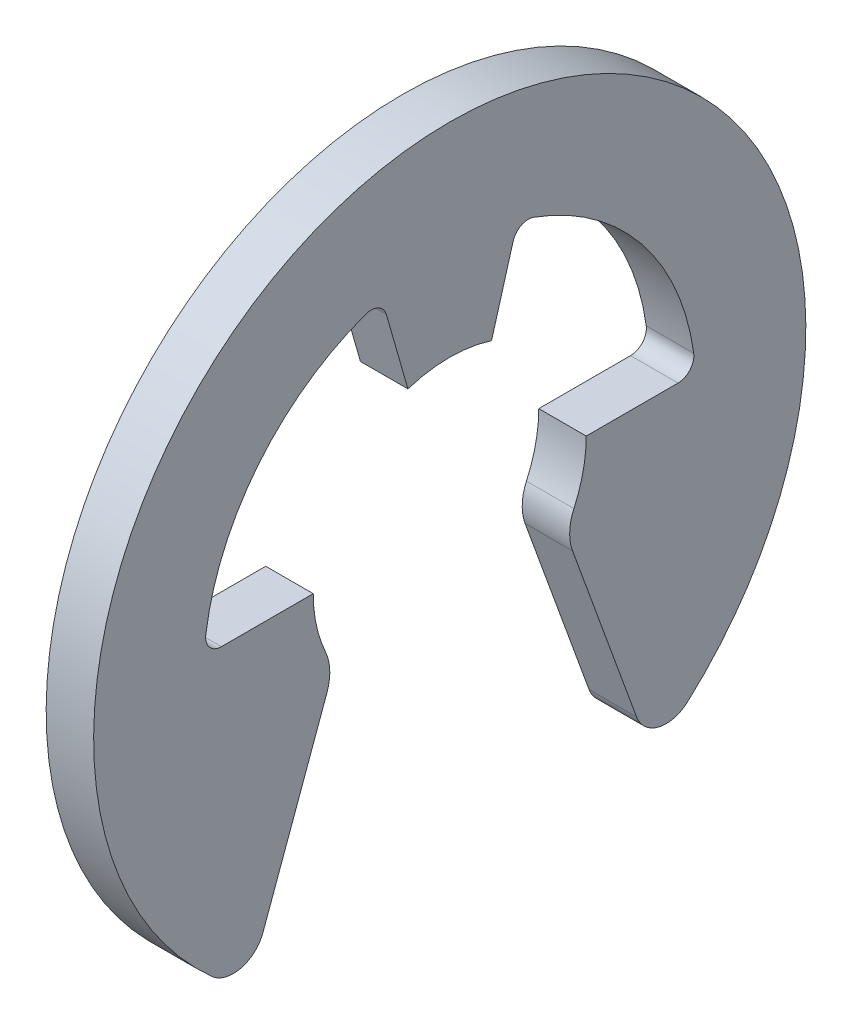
ISO-10303-21;
HEADER;
FILE_DESCRIPTION(('STEP AP214'),'2;1');
FILE_NAME('part.step','',(''),(''),'','','');
FILE_SCHEMA(('AUTOMOTIVE_DESIGN { 1 0 10303 214 1 1 1 1 }'));
ENDSEC;
DATA;
#1=APPLICATION_CONTEXT('core data for automotive mechanical design processes');
#2=APPLICATION_PROTOCOL_DEFINITION('international standard','automotive_design',2000,#1);
#3=PRODUCT_CONTEXT('',#1,'mechanical');
#4=PRODUCT('Part','Part','',(#3));
#5=PRODUCT_RELATED_PRODUCT_CATEGORY('part','',(#4));
#6=PRODUCT_DEFINITION_FORMATION('','',#4);
#7=PRODUCT_DEFINITION_CONTEXT('part definition',#1,'design');
#8=PRODUCT_DEFINITION('design','',#6,#7);
#9=PRODUCT_DEFINITION_SHAPE('','',#8);
#10=(LENGTH_UNIT() NAMED_UNIT(*) SI_UNIT(.MILLI.,.METRE.));
#11=(NAMED_UNIT(*) PLANE_ANGLE_UNIT() SI_UNIT($,.RADIAN.));
#12=(NAMED_UNIT(*) SI_UNIT($,.STERADIAN.) SOLID_ANGLE_UNIT());
#13=UNCERTAINTY_MEASURE_WITH_UNIT(LENGTH_MEASURE(1.E-05),#10,'distance_accuracy_value','');
#14=(GEOMETRIC_REPRESENTATION_CONTEXT(3) GLOBAL_UNCERTAINTY_ASSIGNED_CONTEXT((#13)) GLOBAL_UNIT_ASSIGNED_CONTEXT((#10,
#11,#12)) REPRESENTATION_CONTEXT('',''));
#15=CARTESIAN_POINT('',(0.,0.,0.));
#16=DIRECTION('',(0.,0.,1.));
#17=DIRECTION('',(1.,0.,0.));
#18=AXIS2_PLACEMENT_3D('',#15,#16,#17);
#19=CARTESIAN_POINT('',(0.4,0.266666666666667,-1.92326761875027));
#20=DIRECTION('',(-1.,0.,0.));
#21=DIRECTION('',(0.,0.,1.));
#22=AXIS2_PLACEMENT_3D('',#19,#20,#21);
#23=CYLINDRICAL_SURFACE('',#22,0.133333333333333);
#24=CARTESIAN_POINT('',(0.,0.266666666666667,-1.92326761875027));
#25=DIRECTION('',(-1.,0.,0.));
#26=DIRECTION('',(0.,0.,1.));
#27=AXIS2_PLACEMENT_3D('',#24,#25,#26);
#28=CIRCLE('',#27,0.133333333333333);
#29=CARTESIAN_POINT('',(0.,0.284978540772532,-2.05533749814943));
#30=VERTEX_POINT('',#29);
#31=CARTESIAN_POINT('',(0.,0.133333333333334,-1.92326761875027));
#32=VERTEX_POINT('',#31);
#33=EDGE_CURVE('E179',#30,#32,#28,.T.);
#34=ORIENTED_EDGE('',*,*,#33,.T.);
#35=DIRECTION('',(-1.,0.,0.));
#36=VECTOR('',#35,1.);
#37=CARTESIAN_POINT('',(0.4,0.133333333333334,-1.92326761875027));
#38=LINE('',#37,#36);
#39=CARTESIAN_POINT('',(0.4,0.133333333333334,-1.92326761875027));
#40=VERTEX_POINT('',#39);
#41=EDGE_CURVE('E11',#40,#32,#38,.T.);
#42=ORIENTED_EDGE('',*,*,#41,.F.);
#43=CARTESIAN_POINT('',(0.4,0.266666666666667,-1.92326761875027));
#44=DIRECTION('',(-1.,0.,0.));
#45=DIRECTION('',(0.,0.,1.));
#46=AXIS2_PLACEMENT_3D('',#43,#44,#45);
#47=CIRCLE('',#46,0.133333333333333);
#48=CARTESIAN_POINT('',(0.4,0.284978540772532,-2.05533749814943));
#49=VERTEX_POINT('',#48);
#50=EDGE_CURVE('E238',#49,#40,#47,.T.);
#51=ORIENTED_EDGE('',*,*,#50,.F.);
#52=DIRECTION('',(-1.,0.,0.));
#53=VECTOR('',#52,1.);
#54=CARTESIAN_POINT('',(0.4,0.284978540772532,-2.05533749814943));
#55=LINE('',#54,#53);
#56=EDGE_CURVE('E47',#49,#30,#55,.T.);
#57=ORIENTED_EDGE('',*,*,#56,.T.);
#58=EDGE_LOOP('',(#34,#42,#51,#57));
#59=FACE_BOUND('',#58,.T.);
#60=ADVANCED_FACE('F33',(#59),#23,.F.);
#61=CARTESIAN_POINT('',(0.4,0.133333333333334,-1.15));
#62=DIRECTION('',(0.,1.,0.));
#63=DIRECTION('',(0.,0.,1.));
#64=AXIS2_PLACEMENT_3D('',#61,#62,#63);
#65=PLANE('',#64);
#66=DIRECTION('',(0.,0.,-1.));
#67=VECTOR('',#66,1.);
#68=CARTESIAN_POINT('',(0.,0.133333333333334,-1.15));
#69=LINE('',#68,#67);
#70=CARTESIAN_POINT('',(0.,0.133333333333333,-1.15));
#71=VERTEX_POINT('',#70);
#72=EDGE_CURVE('E174',#71,#32,#69,.T.);
#73=ORIENTED_EDGE('',*,*,#72,.F.);
#74=DIRECTION('',(-1.,0.,0.));
#75=VECTOR('',#74,1.);
#76=CARTESIAN_POINT('',(0.4,0.133333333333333,-1.15));
#77=LINE('',#76,#75);
#78=CARTESIAN_POINT('',(0.4,0.133333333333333,-1.15));
#79=VERTEX_POINT('',#78);
#80=EDGE_CURVE('E40',#79,#71,#77,.T.);
#81=ORIENTED_EDGE('',*,*,#80,.F.);
#82=DIRECTION('',(0.,0.,-1.));
#83=VECTOR('',#82,1.);
#84=CARTESIAN_POINT('',(0.4,0.133333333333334,-1.15));
#85=LINE('',#84,#83);
#86=EDGE_CURVE('E176',#79,#40,#85,.T.);
#87=ORIENTED_EDGE('',*,*,#86,.T.);
#88=ORIENTED_EDGE('',*,*,#41,.T.);
#89=EDGE_LOOP('',(#73,#81,#87,#88));
#90=FACE_BOUND('',#89,.T.);
#91=ADVANCED_FACE('F172',(#90),#65,.T.);
#92=CARTESIAN_POINT('',(0.4,0.133333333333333,0.));
#93=DIRECTION('',(-1.,0.,0.));
#94=DIRECTION('',(0.,0.,1.));
#95=AXIS2_PLACEMENT_3D('',#92,#93,#94);
#96=CYLINDRICAL_SURFACE('',#95,1.15);
#97=CARTESIAN_POINT('',(0.,0.133333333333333,0.));
#98=DIRECTION('',(-1.,0.,0.));
#99=DIRECTION('',(0.,0.,1.));
#100=AXIS2_PLACEMENT_3D('',#97,#98,#99);
#101=CIRCLE('',#100,1.15);
#102=CARTESIAN_POINT('',(0.,-0.343754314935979,-1.04636866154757));
#103=VERTEX_POINT('',#102);
#104=EDGE_CURVE('E187',#71,#103,#101,.T.);
#105=ORIENTED_EDGE('',*,*,#104,.T.);
#106=DIRECTION('',(-1.,0.,0.));
#107=VECTOR('',#106,1.);
#108=CARTESIAN_POINT('',(0.4,-0.343754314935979,-1.04636866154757));
#109=LINE('',#108,#107);
#110=CARTESIAN_POINT('',(0.4,-0.343754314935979,-1.04636866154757));
#111=VERTEX_POINT('',#110);
#112=EDGE_CURVE('E318',#111,#103,#109,.T.);
#113=ORIENTED_EDGE('',*,*,#112,.F.);
#114=CARTESIAN_POINT('',(0.4,0.133333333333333,0.));
#115=DIRECTION('',(-1.,0.,0.));
#116=DIRECTION('',(0.,0.,1.));
#117=AXIS2_PLACEMENT_3D('',#114,#115,#116);
#118=CIRCLE('',#117,1.15);
#119=EDGE_CURVE('E241',#79,#111,#118,.T.);
#120=ORIENTED_EDGE('',*,*,#119,.F.);
#121=ORIENTED_EDGE('',*,*,#80,.T.);
#122=EDGE_LOOP('',(#105,#113,#120,#121));
#123=FACE_BOUND('',#122,.T.);
#124=ADVANCED_FACE('F321',(#123),#96,.F.);
#125=CARTESIAN_POINT('',(0.4,-0.509697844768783,-1.4103229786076));
#126=DIRECTION('',(-1.,0.,0.));
#127=DIRECTION('',(0.,0.,1.));
#128=AXIS2_PLACEMENT_3D('',#125,#126,#127);
#129=CYLINDRICAL_SURFACE('',#128,0.400000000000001);
#130=CARTESIAN_POINT('',(0.,-0.509697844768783,-1.4103229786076));
#131=DIRECTION('',(-1.,0.,0.));
#132=DIRECTION('',(0.,0.,1.));
#133=AXIS2_PLACEMENT_3D('',#130,#131,#132);
#134=CIRCLE('',#133,0.400000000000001);
#135=CARTESIAN_POINT('',(0.,-0.646505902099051,-1.03444593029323));
#136=VERTEX_POINT('',#135);
#137=EDGE_CURVE('E189',#136,#103,#134,.T.);
#138=ORIENTED_EDGE('',*,*,#137,.F.);
#139=DIRECTION('',(-1.,0.,0.));
#140=VECTOR('',#139,1.);
#141=CARTESIAN_POINT('',(0.4,-0.646505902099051,-1.03444593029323));
#142=LINE('',#141,#140);
#143=CARTESIAN_POINT('',(0.4,-0.646505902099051,-1.03444593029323));
#144=VERTEX_POINT('',#143);
#145=EDGE_CURVE('E316',#144,#136,#142,.T.);
#146=ORIENTED_EDGE('',*,*,#145,.F.);
#147=CARTESIAN_POINT('',(0.4,-0.509697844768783,-1.4103229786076));
#148=DIRECTION('',(-1.,0.,0.));
#149=DIRECTION('',(0.,0.,1.));
#150=AXIS2_PLACEMENT_3D('',#147,#148,#149);
#151=CIRCLE('',#150,0.400000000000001);
#152=EDGE_CURVE('E243',#144,#111,#151,.T.);
#153=ORIENTED_EDGE('',*,*,#152,.T.);
#154=ORIENTED_EDGE('',*,*,#112,.T.);
#155=EDGE_LOOP('',(#138,#146,#153,#154));
#156=FACE_BOUND('',#155,.T.);
#157=ADVANCED_FACE('F392',(#156),#129,.T.);
#158=CARTESIAN_POINT('',(0.4,-0.646505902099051,-1.03444593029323));
#159=DIRECTION('',(0.,0.34202014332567,-0.939692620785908));
#160=DIRECTION('',(0.,0.939692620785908,0.34202014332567));
#161=AXIS2_PLACEMENT_3D('',#158,#159,#160);
#162=PLANE('',#161);
#163=DIRECTION('',(0.,-0.939692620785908,-0.34202014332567));
#164=VECTOR('',#163,1.);
#165=CARTESIAN_POINT('',(0.,-0.646505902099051,-1.03444593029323));
#166=LINE('',#165,#164);
#167=CARTESIAN_POINT('',(0.,-2.12701661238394,-1.57330776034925));
#168=VERTEX_POINT('',#167);
#169=EDGE_CURVE('E193',#136,#168,#166,.T.);
#170=ORIENTED_EDGE('',*,*,#169,.T.);
#171=DIRECTION('',(-1.,0.,0.));
#172=VECTOR('',#171,1.);
#173=CARTESIAN_POINT('',(0.4,-2.12701661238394,-1.57330776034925));
#174=LINE('',#173,#172);
#175=CARTESIAN_POINT('',(0.4,-2.12701661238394,-1.57330776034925));
#176=VERTEX_POINT('',#175);
#177=EDGE_CURVE('E314',#176,#168,#174,.T.);
#178=ORIENTED_EDGE('',*,*,#177,.F.);
#179=DIRECTION('',(0.,-0.939692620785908,-0.34202014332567));
#180=VECTOR('',#179,1.);
#181=CARTESIAN_POINT('',(0.4,-0.646505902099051,-1.03444593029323));
#182=LINE('',#181,#180);
#183=EDGE_CURVE('E246',#144,#176,#182,.T.);
#184=ORIENTED_EDGE('',*,*,#183,.F.);
#185=ORIENTED_EDGE('',*,*,#145,.T.);
#186=EDGE_LOOP('',(#170,#178,#184,#185));
#187=FACE_BOUND('',#186,.T.);
#188=ADVANCED_FACE('F389',(#187),#162,.F.);
#189=CARTESIAN_POINT('',(0.4,-2.03581124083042,-1.82389245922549));
#190=DIRECTION('',(-1.,0.,0.));
#191=DIRECTION('',(0.,0.,1.));
#192=AXIS2_PLACEMENT_3D('',#189,#190,#191);
#193=CYLINDRICAL_SURFACE('',#192,0.266666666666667);
#194=CARTESIAN_POINT('',(0.,-2.03581124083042,-1.82389245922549));
#195=DIRECTION('',(-1.,0.,0.));
#196=DIRECTION('',(0.,0.,1.));
#197=AXIS2_PLACEMENT_3D('',#194,#195,#196);
#198=CIRCLE('',#197,0.266666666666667);
#199=CARTESIAN_POINT('',(0.,-2.23442697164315,-2.0018331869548));
#200=VERTEX_POINT('',#199);
#201=EDGE_CURVE('E196',#200,#168,#198,.T.);
#202=ORIENTED_EDGE('',*,*,#201,.F.);
#203=DIRECTION('',(-1.,0.,0.));
#204=VECTOR('',#203,1.);
#205=CARTESIAN_POINT('',(0.4,-2.23442697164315,-2.0018331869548));
#206=LINE('',#205,#204);
#207=CARTESIAN_POINT('',(0.4,-2.23442697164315,-2.0018331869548));
#208=VERTEX_POINT('',#207);
#209=EDGE_CURVE('E312',#208,#200,#206,.T.);
#210=ORIENTED_EDGE('',*,*,#209,.F.);
#211=CARTESIAN_POINT('',(0.4,-2.03581124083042,-1.82389245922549));
#212=DIRECTION('',(-1.,0.,0.));
#213=DIRECTION('',(0.,0.,1.));
#214=AXIS2_PLACEMENT_3D('',#211,#212,#213);
#215=CIRCLE('',#214,0.266666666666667);
#216=EDGE_CURVE('E248',#208,#176,#215,.T.);
#217=ORIENTED_EDGE('',*,*,#216,.T.);
#218=ORIENTED_EDGE('',*,*,#177,.T.);
#219=EDGE_LOOP('',(#202,#210,#217,#218));
#220=FACE_BOUND('',#219,.T.);
#221=ADVANCED_FACE('F383',(#220),#193,.T.);
#222=CARTESIAN_POINT('',(0.4,0.,0.));
#223=DIRECTION('',(-1.,0.,0.));
#224=DIRECTION('',(0.,0.,1.));
#225=AXIS2_PLACEMENT_3D('',#222,#223,#224);
#226=CYLINDRICAL_SURFACE('',#225,3.);
#227=CARTESIAN_POINT('',(0.,0.,0.));
#228=DIRECTION('',(1.,0.,0.));
#229=DIRECTION('',(0.,0.,-1.));
#230=AXIS2_PLACEMENT_3D('',#227,#228,#229);
#231=CIRCLE('',#230,3.);
#232=CARTESIAN_POINT('',(0.,-2.23442697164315,2.0018331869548));
#233=VERTEX_POINT('',#232);
#234=EDGE_CURVE('E199',#200,#233,#231,.T.);
#235=ORIENTED_EDGE('',*,*,#234,.T.);
#236=DIRECTION('',(-1.,0.,0.));
#237=VECTOR('',#236,1.);
#238=CARTESIAN_POINT('',(0.4,-2.23442697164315,2.0018331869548));
#239=LINE('',#238,#237);
#240=CARTESIAN_POINT('',(0.4,-2.23442697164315,2.0018331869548));
#241=VERTEX_POINT('',#240);
#242=EDGE_CURVE('E309',#241,#233,#239,.T.);
#243=ORIENTED_EDGE('',*,*,#242,.F.);
#244=CARTESIAN_POINT('',(0.4,0.,0.));
#245=DIRECTION('',(1.,0.,0.));
#246=DIRECTION('',(0.,0.,-1.));
#247=AXIS2_PLACEMENT_3D('',#244,#245,#246);
#248=CIRCLE('',#247,3.);
#249=EDGE_CURVE('E251',#208,#241,#248,.T.);
#250=ORIENTED_EDGE('',*,*,#249,.F.);
#251=ORIENTED_EDGE('',*,*,#209,.T.);
#252=EDGE_LOOP('',(#235,#243,#250,#251));
#253=FACE_BOUND('',#252,.T.);
#254=ADVANCED_FACE('F393',(#253),#226,.T.);
#255=CARTESIAN_POINT('',(0.4,-2.03581124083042,1.82389245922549));
#256=DIRECTION('',(-1.,0.,0.));
#257=DIRECTION('',(0.,0.,1.));
#258=AXIS2_PLACEMENT_3D('',#255,#256,#257);
#259=CYLINDRICAL_SURFACE('',#258,0.266666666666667);
#260=CARTESIAN_POINT('',(0.,-2.03581124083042,1.82389245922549));
#261=DIRECTION('',(1.,0.,0.));
#262=DIRECTION('',(0.,0.,-1.));
#263=AXIS2_PLACEMENT_3D('',#260,#261,#262);
#264=CIRCLE('',#263,0.266666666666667);
#265=CARTESIAN_POINT('',(0.,-2.12701661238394,1.57330776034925));
#266=VERTEX_POINT('',#265);
#267=EDGE_CURVE('E201',#233,#266,#264,.T.);
#268=ORIENTED_EDGE('',*,*,#267,.T.);
#269=DIRECTION('',(-1.,0.,0.));
#270=VECTOR('',#269,1.);
#271=CARTESIAN_POINT('',(0.4,-2.12701661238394,1.57330776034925));
#272=LINE('',#271,#270);
#273=CARTESIAN_POINT('',(0.4,-2.12701661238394,1.57330776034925));
#274=VERTEX_POINT('',#273);
#275=EDGE_CURVE('E307',#274,#266,#272,.T.);
#276=ORIENTED_EDGE('',*,*,#275,.F.);
#277=CARTESIAN_POINT('',(0.4,-2.03581124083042,1.82389245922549));
#278=DIRECTION('',(1.,0.,0.));
#279=DIRECTION('',(0.,0.,-1.));
#280=AXIS2_PLACEMENT_3D('',#277,#278,#279);
#281=CIRCLE('',#280,0.266666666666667);
#282=EDGE_CURVE('E253',#241,#274,#281,.T.);
#283=ORIENTED_EDGE('',*,*,#282,.F.);
#284=ORIENTED_EDGE('',*,*,#242,.T.);
#285=EDGE_LOOP('',(#268,#276,#283,#284));
#286=FACE_BOUND('',#285,.T.);
#287=ADVANCED_FACE('F376',(#286),#259,.T.);
#288=CARTESIAN_POINT('',(0.4,-0.646505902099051,1.03444593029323));
#289=DIRECTION('',(0.,-0.342020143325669,-0.939692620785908));
#290=DIRECTION('',(0.,0.939692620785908,-0.342020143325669));
#291=AXIS2_PLACEMENT_3D('',#288,#289,#290);
#292=PLANE('',#291);
#293=DIRECTION('',(0.,-0.939692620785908,0.342020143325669));
#294=VECTOR('',#293,1.);
#295=CARTESIAN_POINT('',(0.,-0.646505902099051,1.03444593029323));
#296=LINE('',#295,#294);
#297=CARTESIAN_POINT('',(0.,-0.646505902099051,1.03444593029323));
#298=VERTEX_POINT('',#297);
#299=EDGE_CURVE('E204',#298,#266,#296,.T.);
#300=ORIENTED_EDGE('',*,*,#299,.F.);
#301=DIRECTION('',(-1.,0.,0.));
#302=VECTOR('',#301,1.);
#303=CARTESIAN_POINT('',(0.4,-0.646505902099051,1.03444593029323));
#304=LINE('',#303,#302);
#305=CARTESIAN_POINT('',(0.4,-0.646505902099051,1.03444593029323));
#306=VERTEX_POINT('',#305);
#307=EDGE_CURVE('E305',#306,#298,#304,.T.);
#308=ORIENTED_EDGE('',*,*,#307,.F.);
#309=DIRECTION('',(0.,-0.939692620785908,0.342020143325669));
#310=VECTOR('',#309,1.);
#311=CARTESIAN_POINT('',(0.4,-0.646505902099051,1.03444593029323));
#312=LINE('',#311,#310);
#313=EDGE_CURVE('E255',#306,#274,#312,.T.);
#314=ORIENTED_EDGE('',*,*,#313,.T.);
#315=ORIENTED_EDGE('',*,*,#275,.T.);
#316=EDGE_LOOP('',(#300,#308,#314,#315));
#317=FACE_BOUND('',#316,.T.);
#318=ADVANCED_FACE('F371',(#317),#292,.T.);
#319=CARTESIAN_POINT('',(0.4,-0.509697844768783,1.4103229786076));
#320=DIRECTION('',(-1.,0.,0.));
#321=DIRECTION('',(0.,0.,1.));
#322=AXIS2_PLACEMENT_3D('',#319,#320,#321);
#323=CYLINDRICAL_SURFACE('',#322,0.400000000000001);
#324=CARTESIAN_POINT('',(0.,-0.509697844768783,1.4103229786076));
#325=DIRECTION('',(1.,0.,0.));
#326=DIRECTION('',(0.,0.,-1.));
#327=AXIS2_PLACEMENT_3D('',#324,#325,#326);
#328=CIRCLE('',#327,0.400000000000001);
#329=CARTESIAN_POINT('',(0.,-0.343754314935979,1.04636866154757));
#330=VERTEX_POINT('',#329);
#331=EDGE_CURVE('E207',#298,#330,#328,.T.);
#332=ORIENTED_EDGE('',*,*,#331,.T.);
#333=DIRECTION('',(-1.,0.,0.));
#334=VECTOR('',#333,1.);
#335=CARTESIAN_POINT('',(0.4,-0.343754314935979,1.04636866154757));
#336=LINE('',#335,#334);
#337=CARTESIAN_POINT('',(0.4,-0.343754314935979,1.04636866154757));
#338=VERTEX_POINT('',#337);
#339=EDGE_CURVE('E303',#338,#330,#336,.T.);
#340=ORIENTED_EDGE('',*,*,#339,.F.);
#341=CARTESIAN_POINT('',(0.4,-0.509697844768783,1.4103229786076));
#342=DIRECTION('',(1.,0.,0.));
#343=DIRECTION('',(0.,0.,-1.));
#344=AXIS2_PLACEMENT_3D('',#341,#342,#343);
#345=CIRCLE('',#344,0.400000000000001);
#346=EDGE_CURVE('E258',#306,#338,#345,.T.);
#347=ORIENTED_EDGE('',*,*,#346,.F.);
#348=ORIENTED_EDGE('',*,*,#307,.T.);
#349=EDGE_LOOP('',(#332,#340,#347,#348));
#350=FACE_BOUND('',#349,.T.);
#351=ADVANCED_FACE('F367',(#350),#323,.T.);
#352=CARTESIAN_POINT('',(0.4,0.133333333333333,0.));
#353=DIRECTION('',(-1.,0.,0.));
#354=DIRECTION('',(0.,0.,1.));
#355=AXIS2_PLACEMENT_3D('',#352,#353,#354);
#356=CYLINDRICAL_SURFACE('',#355,1.15);
#357=CARTESIAN_POINT('',(0.,0.133333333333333,0.));
#358=DIRECTION('',(1.,0.,0.));
#359=DIRECTION('',(0.,0.,-1.));
#360=AXIS2_PLACEMENT_3D('',#357,#358,#359);
#361=CIRCLE('',#360,1.15);
#362=CARTESIAN_POINT('',(0.,0.133333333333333,1.15));
#363=VERTEX_POINT('',#362);
#364=EDGE_CURVE('E210',#363,#330,#361,.T.);
#365=ORIENTED_EDGE('',*,*,#364,.F.);
#366=DIRECTION('',(-1.,0.,0.));
#367=VECTOR('',#366,1.);
#368=CARTESIAN_POINT('',(0.4,0.133333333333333,1.15));
#369=LINE('',#368,#367);
#370=CARTESIAN_POINT('',(0.4,0.133333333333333,1.15));
#371=VERTEX_POINT('',#370);
#372=EDGE_CURVE('E301',#371,#363,#369,.T.);
#373=ORIENTED_EDGE('',*,*,#372,.F.);
#374=CARTESIAN_POINT('',(0.4,0.133333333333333,0.));
#375=DIRECTION('',(1.,0.,0.));
#376=DIRECTION('',(0.,0.,-1.));
#377=AXIS2_PLACEMENT_3D('',#374,#375,#376);
#378=CIRCLE('',#377,1.15);
#379=EDGE_CURVE('E260',#371,#338,#378,.T.);
#380=ORIENTED_EDGE('',*,*,#379,.T.);
#381=ORIENTED_EDGE('',*,*,#339,.T.);
#382=EDGE_LOOP('',(#365,#373,#380,#381));
#383=FACE_BOUND('',#382,.T.);
#384=ADVANCED_FACE('F361',(#383),#356,.F.);
#385=CARTESIAN_POINT('',(0.4,0.133333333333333,1.15));
#386=DIRECTION('',(0.,-1.,0.));
#387=DIRECTION('',(0.,0.,-1.));
#388=AXIS2_PLACEMENT_3D('',#385,#386,#387);
#389=PLANE('',#388);
#390=DIRECTION('',(0.,0.,1.));
#391=VECTOR('',#390,1.);
#392=CARTESIAN_POINT('',(0.,0.133333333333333,1.15));
#393=LINE('',#392,#391);
#394=CARTESIAN_POINT('',(0.,0.133333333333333,1.92326761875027));
#395=VERTEX_POINT('',#394);
#396=EDGE_CURVE('E213',#363,#395,#393,.T.);
#397=ORIENTED_EDGE('',*,*,#396,.T.);
#398=DIRECTION('',(-1.,0.,0.));
#399=VECTOR('',#398,1.);
#400=CARTESIAN_POINT('',(0.4,0.133333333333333,1.92326761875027));
#401=LINE('',#400,#399);
#402=CARTESIAN_POINT('',(0.4,0.133333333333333,1.92326761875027));
#403=VERTEX_POINT('',#402);
#404=EDGE_CURVE('E299',#403,#395,#401,.T.);
#405=ORIENTED_EDGE('',*,*,#404,.F.);
#406=DIRECTION('',(0.,0.,1.));
#407=VECTOR('',#406,1.);
#408=CARTESIAN_POINT('',(0.4,0.133333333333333,1.15));
#409=LINE('',#408,#407);
#410=EDGE_CURVE('E263',#371,#403,#409,.T.);
#411=ORIENTED_EDGE('',*,*,#410,.F.);
#412=ORIENTED_EDGE('',*,*,#372,.T.);
#413=EDGE_LOOP('',(#397,#405,#411,#412));
#414=FACE_BOUND('',#413,.T.);
#415=ADVANCED_FACE('F457',(#414),#389,.F.);
#416=CARTESIAN_POINT('',(0.4,0.266666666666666,1.92326761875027));
#417=DIRECTION('',(-1.,0.,0.));
#418=DIRECTION('',(0.,0.,1.));
#419=AXIS2_PLACEMENT_3D('',#416,#417,#418);
#420=CYLINDRICAL_SURFACE('',#419,0.133333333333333);
#421=CARTESIAN_POINT('',(0.,0.266666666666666,1.92326761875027));
#422=DIRECTION('',(1.,0.,0.));
#423=DIRECTION('',(0.,0.,-1.));
#424=AXIS2_PLACEMENT_3D('',#421,#422,#423);
#425=CIRCLE('',#424,0.133333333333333);
#426=CARTESIAN_POINT('',(0.,0.284978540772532,2.05533749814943));
#427=VERTEX_POINT('',#426);
#428=EDGE_CURVE('E216',#427,#395,#425,.T.);
#429=ORIENTED_EDGE('',*,*,#428,.F.);
#430=DIRECTION('',(-1.,0.,0.));
#431=VECTOR('',#430,1.);
#432=CARTESIAN_POINT('',(0.4,0.284978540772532,2.05533749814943));
#433=LINE('',#432,#431);
#434=CARTESIAN_POINT('',(0.4,0.284978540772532,2.05533749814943));
#435=VERTEX_POINT('',#434);
#436=EDGE_CURVE('E297',#435,#427,#433,.T.);
#437=ORIENTED_EDGE('',*,*,#436,.F.);
#438=CARTESIAN_POINT('',(0.4,0.266666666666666,1.92326761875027));
#439=DIRECTION('',(1.,0.,0.));
#440=DIRECTION('',(0.,0.,-1.));
#441=AXIS2_PLACEMENT_3D('',#438,#439,#440);
#442=CIRCLE('',#441,0.133333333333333);
#443=EDGE_CURVE('E265',#435,#403,#442,.T.);
#444=ORIENTED_EDGE('',*,*,#443,.T.);
#445=ORIENTED_EDGE('',*,*,#404,.T.);
#446=EDGE_LOOP('',(#429,#437,#444,#445));
#447=FACE_BOUND('',#446,.T.);
#448=ADVANCED_FACE('F354',(#447),#420,.F.);
#449=CARTESIAN_POINT('',(0.4,0.,0.));
#450=DIRECTION('',(-1.,0.,0.));
#451=DIRECTION('',(0.,0.,1.));
#452=AXIS2_PLACEMENT_3D('',#449,#450,#451);
#453=CYLINDRICAL_SURFACE('',#452,2.075);
#454=CARTESIAN_POINT('',(0.,0.,0.));
#455=DIRECTION('',(-1.,0.,0.));
#456=DIRECTION('',(0.,0.,1.));
#457=AXIS2_PLACEMENT_3D('',#454,#455,#456);
#458=CIRCLE('',#457,2.075);
#459=CARTESIAN_POINT('',(0.,1.95063428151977,0.707566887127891));
#460=VERTEX_POINT('',#459);
#461=EDGE_CURVE('E219',#427,#460,#458,.T.);
#462=ORIENTED_EDGE('',*,*,#461,.T.);
#463=DIRECTION('',(-1.,0.,0.));
#464=VECTOR('',#463,1.);
#465=CARTESIAN_POINT('',(0.4,1.95063428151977,0.707566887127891));
#466=LINE('',#465,#464);
#467=CARTESIAN_POINT('',(0.4,1.95063428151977,0.707566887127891));
#468=VERTEX_POINT('',#467);
#469=EDGE_CURVE('E294',#468,#460,#466,.T.);
#470=ORIENTED_EDGE('',*,*,#469,.F.);
#471=CARTESIAN_POINT('',(0.4,0.,0.));
#472=DIRECTION('',(-1.,0.,0.));
#473=DIRECTION('',(0.,0.,1.));
#474=AXIS2_PLACEMENT_3D('',#471,#472,#473);
#475=CIRCLE('',#474,2.075);
#476=EDGE_CURVE('E268',#435,#468,#475,.T.);
#477=ORIENTED_EDGE('',*,*,#476,.F.);
#478=ORIENTED_EDGE('',*,*,#436,.T.);
#479=EDGE_LOOP('',(#462,#470,#477,#478));
#480=FACE_BOUND('',#479,.T.);
#481=ADVANCED_FACE('F351',(#480),#453,.F.);
#482=CARTESIAN_POINT('',(0.4,1.82529231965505,0.662100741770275));
#483=DIRECTION('',(-1.,0.,0.));
#484=DIRECTION('',(0.,0.,1.));
#485=AXIS2_PLACEMENT_3D('',#482,#483,#484);
#486=CYLINDRICAL_SURFACE('',#485,0.133333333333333);
#487=CARTESIAN_POINT('',(0.,1.82529231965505,0.662100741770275));
#488=DIRECTION('',(-1.,0.,0.));
#489=DIRECTION('',(0.,0.,1.));
#490=AXIS2_PLACEMENT_3D('',#487,#488,#489);
#491=CIRCLE('',#490,0.133333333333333);
#492=CARTESIAN_POINT('',(0.,1.86204396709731,0.533932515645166));
#493=VERTEX_POINT('',#492);
#494=EDGE_CURVE('E221',#460,#493,#491,.T.);
#495=ORIENTED_EDGE('',*,*,#494,.T.);
#496=DIRECTION('',(-1.,0.,0.));
#497=VECTOR('',#496,1.);
#498=CARTESIAN_POINT('',(0.4,1.86204396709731,0.533932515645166));
#499=LINE('',#498,#497);
#500=CARTESIAN_POINT('',(0.4,1.86204396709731,0.533932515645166));
#501=VERTEX_POINT('',#500);
#502=EDGE_CURVE('E292',#501,#493,#499,.T.);
#503=ORIENTED_EDGE('',*,*,#502,.F.);
#504=CARTESIAN_POINT('',(0.4,1.82529231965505,0.662100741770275));
#505=DIRECTION('',(-1.,0.,0.));
#506=DIRECTION('',(0.,0.,1.));
#507=AXIS2_PLACEMENT_3D('',#504,#505,#506);
#508=CIRCLE('',#507,0.133333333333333);
#509=EDGE_CURVE('E270',#468,#501,#508,.T.);
#510=ORIENTED_EDGE('',*,*,#509,.F.);
#511=ORIENTED_EDGE('',*,*,#469,.T.);
#512=EDGE_LOOP('',(#495,#503,#510,#511));
#513=FACE_BOUND('',#512,.T.);
#514=ADVANCED_FACE('F346',(#513),#486,.F.);
#515=CARTESIAN_POINT('',(0.4,1.22808950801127,0.352148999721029));
#516=DIRECTION('',(0.,-0.275637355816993,0.961261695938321));
#517=DIRECTION('',(0.,-0.961261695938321,-0.275637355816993));
#518=AXIS2_PLACEMENT_3D('',#515,#516,#517);
#519=PLANE('',#518);
#520=DIRECTION('',(0.,0.961261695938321,0.275637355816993));
#521=VECTOR('',#520,1.);
#522=CARTESIAN_POINT('',(0.,1.22808950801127,0.352148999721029));
#523=LINE('',#522,#521);
#524=CARTESIAN_POINT('',(0.,1.22808950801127,0.352148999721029));
#525=VERTEX_POINT('',#524);
#526=EDGE_CURVE('E224',#525,#493,#523,.T.);
#527=ORIENTED_EDGE('',*,*,#526,.F.);
#528=DIRECTION('',(-1.,0.,0.));
#529=VECTOR('',#528,1.);
#530=CARTESIAN_POINT('',(0.4,1.22808950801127,0.352148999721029));
#531=LINE('',#530,#529);
#532=CARTESIAN_POINT('',(0.4,1.22808950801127,0.352148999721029));
#533=VERTEX_POINT('',#532);
#534=EDGE_CURVE('E290',#533,#525,#531,.T.);
#535=ORIENTED_EDGE('',*,*,#534,.F.);
#536=DIRECTION('',(0.,0.961261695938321,0.275637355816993));
#537=VECTOR('',#536,1.);
#538=CARTESIAN_POINT('',(0.4,1.22808950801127,0.352148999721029));
#539=LINE('',#538,#537);
#540=EDGE_CURVE('E272',#533,#501,#539,.T.);
#541=ORIENTED_EDGE('',*,*,#540,.T.);
#542=ORIENTED_EDGE('',*,*,#502,.T.);
#543=EDGE_LOOP('',(#527,#535,#541,#542));
#544=FACE_BOUND('',#543,.T.);
#545=ADVANCED_FACE('F340',(#544),#519,.T.);
#546=CARTESIAN_POINT('',(0.4,0.133333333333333,0.));
#547=DIRECTION('',(-1.,0.,0.));
#548=DIRECTION('',(0.,0.,1.));
#549=AXIS2_PLACEMENT_3D('',#546,#547,#548);
#550=CYLINDRICAL_SURFACE('',#549,1.15);
#551=CARTESIAN_POINT('',(0.,0.133333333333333,0.));
#552=DIRECTION('',(1.,0.,0.));
#553=DIRECTION('',(0.,0.,-1.));
#554=AXIS2_PLACEMENT_3D('',#551,#552,#553);
#555=CIRCLE('',#554,1.15);
#556=CARTESIAN_POINT('',(0.,1.22808950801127,-0.352148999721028));
#557=VERTEX_POINT('',#556);
#558=EDGE_CURVE('E227',#557,#525,#555,.T.);
#559=ORIENTED_EDGE('',*,*,#558,.F.);
#560=DIRECTION('',(-1.,0.,0.));
#561=VECTOR('',#560,1.);
#562=CARTESIAN_POINT('',(0.4,1.22808950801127,-0.352148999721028));
#563=LINE('',#562,#561);
#564=CARTESIAN_POINT('',(0.4,1.22808950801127,-0.352148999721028));
#565=VERTEX_POINT('',#564);
#566=EDGE_CURVE('E288',#565,#557,#563,.T.);
#567=ORIENTED_EDGE('',*,*,#566,.F.);
#568=CARTESIAN_POINT('',(0.4,0.133333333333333,0.));
#569=DIRECTION('',(1.,0.,0.));
#570=DIRECTION('',(0.,0.,-1.));
#571=AXIS2_PLACEMENT_3D('',#568,#569,#570);
#572=CIRCLE('',#571,1.15);
#573=EDGE_CURVE('E275',#565,#533,#572,.T.);
#574=ORIENTED_EDGE('',*,*,#573,.T.);
#575=ORIENTED_EDGE('',*,*,#534,.T.);
#576=EDGE_LOOP('',(#559,#567,#574,#575));
#577=FACE_BOUND('',#576,.T.);
#578=ADVANCED_FACE('F334',(#577),#550,.F.);
#579=CARTESIAN_POINT('',(0.4,1.22808950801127,-0.352148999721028));
#580=DIRECTION('',(0.,0.275637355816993,0.961261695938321));
#581=DIRECTION('',(0.,-0.961261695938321,0.275637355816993));
#582=AXIS2_PLACEMENT_3D('',#579,#580,#581);
#583=PLANE('',#582);
#584=DIRECTION('',(0.,0.961261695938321,-0.275637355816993));
#585=VECTOR('',#584,1.);
#586=CARTESIAN_POINT('',(0.,1.22808950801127,-0.352148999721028));
#587=LINE('',#586,#585);
#588=CARTESIAN_POINT('',(0.,1.86204396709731,-0.533932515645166));
#589=VERTEX_POINT('',#588);
#590=EDGE_CURVE('E230',#557,#589,#587,.T.);
#591=ORIENTED_EDGE('',*,*,#590,.T.);
#592=DIRECTION('',(-1.,0.,0.));
#593=VECTOR('',#592,1.);
#594=CARTESIAN_POINT('',(0.4,1.86204396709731,-0.533932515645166));
#595=LINE('',#594,#593);
#596=CARTESIAN_POINT('',(0.4,1.86204396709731,-0.533932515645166));
#597=VERTEX_POINT('',#596);
#598=EDGE_CURVE('E286',#597,#589,#595,.T.);
#599=ORIENTED_EDGE('',*,*,#598,.F.);
#600=DIRECTION('',(0.,0.961261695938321,-0.275637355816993));
#601=VECTOR('',#600,1.);
#602=CARTESIAN_POINT('',(0.4,1.22808950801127,-0.352148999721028));
#603=LINE('',#602,#601);
#604=EDGE_CURVE('E278',#565,#597,#603,.T.);
#605=ORIENTED_EDGE('',*,*,#604,.F.);
#606=ORIENTED_EDGE('',*,*,#566,.T.);
#607=EDGE_LOOP('',(#591,#599,#605,#606));
#608=FACE_BOUND('',#607,.T.);
#609=ADVANCED_FACE('F506',(#608),#583,.F.);
#610=CARTESIAN_POINT('',(0.4,1.82529231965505,-0.662100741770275));
#611=DIRECTION('',(-1.,0.,0.));
#612=DIRECTION('',(0.,0.,1.));
#613=AXIS2_PLACEMENT_3D('',#610,#611,#612);
#614=CYLINDRICAL_SURFACE('',#613,0.133333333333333);
#615=CARTESIAN_POINT('',(0.,1.82529231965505,-0.662100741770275));
#616=DIRECTION('',(1.,0.,0.));
#617=DIRECTION('',(0.,0.,-1.));
#618=AXIS2_PLACEMENT_3D('',#615,#616,#617);
#619=CIRCLE('',#618,0.133333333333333);
#620=CARTESIAN_POINT('',(0.,1.95063428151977,-0.70756688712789));
#621=VERTEX_POINT('',#620);
#622=EDGE_CURVE('E233',#621,#589,#619,.T.);
#623=ORIENTED_EDGE('',*,*,#622,.F.);
#624=DIRECTION('',(-1.,0.,0.));
#625=VECTOR('',#624,1.);
#626=CARTESIAN_POINT('',(0.4,1.95063428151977,-0.70756688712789));
#627=LINE('',#626,#625);
#628=CARTESIAN_POINT('',(0.4,1.95063428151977,-0.70756688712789));
#629=VERTEX_POINT('',#628);
#630=EDGE_CURVE('E55',#629,#621,#627,.T.);
#631=ORIENTED_EDGE('',*,*,#630,.F.);
#632=CARTESIAN_POINT('',(0.4,1.82529231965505,-0.662100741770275));
#633=DIRECTION('',(1.,0.,0.));
#634=DIRECTION('',(0.,0.,-1.));
#635=AXIS2_PLACEMENT_3D('',#632,#633,#634);
#636=CIRCLE('',#635,0.133333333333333);
#637=EDGE_CURVE('E280',#629,#597,#636,.T.);
#638=ORIENTED_EDGE('',*,*,#637,.T.);
#639=ORIENTED_EDGE('',*,*,#598,.T.);
#640=EDGE_LOOP('',(#623,#631,#638,#639));
#641=FACE_BOUND('',#640,.T.);
#642=ADVANCED_FACE('F328',(#641),#614,.F.);
#643=CARTESIAN_POINT('',(0.4,0.,0.));
#644=DIRECTION('',(-1.,0.,0.));
#645=DIRECTION('',(0.,0.,1.));
#646=AXIS2_PLACEMENT_3D('',#643,#644,#645);
#647=CYLINDRICAL_SURFACE('',#646,2.075);
#648=CARTESIAN_POINT('',(0.,0.,0.));
#649=DIRECTION('',(1.,0.,0.));
#650=DIRECTION('',(0.,0.,-1.));
#651=AXIS2_PLACEMENT_3D('',#648,#649,#650);
#652=CIRCLE('',#651,2.075);
#653=EDGE_CURVE('E236',#30,#621,#652,.T.);
#654=ORIENTED_EDGE('',*,*,#653,.F.);
#655=ORIENTED_EDGE('',*,*,#56,.F.);
#656=CARTESIAN_POINT('',(0.4,0.,0.));
#657=DIRECTION('',(1.,0.,0.));
#658=DIRECTION('',(0.,0.,-1.));
#659=AXIS2_PLACEMENT_3D('',#656,#657,#658);
#660=CIRCLE('',#659,2.075);
#661=EDGE_CURVE('E282',#49,#629,#660,.T.);
#662=ORIENTED_EDGE('',*,*,#661,.T.);
#663=ORIENTED_EDGE('',*,*,#630,.T.);
#664=EDGE_LOOP('',(#654,#655,#662,#663));
#665=FACE_BOUND('',#664,.T.);
#666=ADVANCED_FACE('F327',(#665),#647,.F.);
#667=CARTESIAN_POINT('',(0.4,0.266666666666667,-1.92326761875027));
#668=DIRECTION('',(-1.,0.,0.));
#669=DIRECTION('',(0.,0.,1.));
#670=AXIS2_PLACEMENT_3D('',#667,#668,#669);
#671=PLANE('',#670);
#672=ORIENTED_EDGE('',*,*,#50,.T.);
#673=ORIENTED_EDGE('',*,*,#86,.F.);
#674=ORIENTED_EDGE('',*,*,#119,.T.);
#675=ORIENTED_EDGE('',*,*,#152,.F.);
#676=ORIENTED_EDGE('',*,*,#183,.T.);
#677=ORIENTED_EDGE('',*,*,#216,.F.);
#678=ORIENTED_EDGE('',*,*,#249,.T.);
#679=ORIENTED_EDGE('',*,*,#282,.T.);
#680=ORIENTED_EDGE('',*,*,#313,.F.);
#681=ORIENTED_EDGE('',*,*,#346,.T.);
#682=ORIENTED_EDGE('',*,*,#379,.F.);
#683=ORIENTED_EDGE('',*,*,#410,.T.);
#684=ORIENTED_EDGE('',*,*,#443,.F.);
#685=ORIENTED_EDGE('',*,*,#476,.T.);
#686=ORIENTED_EDGE('',*,*,#509,.T.);
#687=ORIENTED_EDGE('',*,*,#540,.F.);
#688=ORIENTED_EDGE('',*,*,#573,.F.);
#689=ORIENTED_EDGE('',*,*,#604,.T.);
#690=ORIENTED_EDGE('',*,*,#637,.F.);
#691=ORIENTED_EDGE('',*,*,#661,.F.);
#692=EDGE_LOOP('',(#672,#673,#674,#675,#676,#677,#678,#679,#680,#681,#682,#683,#684,#685,#686,
#687,#688,#689,#690,#691));
#693=FACE_BOUND('',#692,.T.);
#694=ADVANCED_FACE('F325',(#693),#671,.F.);
#695=CARTESIAN_POINT('',(0.,0.266666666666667,-1.92326761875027));
#696=DIRECTION('',(-1.,0.,0.));
#697=DIRECTION('',(0.,0.,1.));
#698=AXIS2_PLACEMENT_3D('',#695,#696,#697);
#699=PLANE('',#698);
#700=ORIENTED_EDGE('',*,*,#33,.F.);
#701=ORIENTED_EDGE('',*,*,#653,.T.);
#702=ORIENTED_EDGE('',*,*,#622,.T.);
#703=ORIENTED_EDGE('',*,*,#590,.F.);
#704=ORIENTED_EDGE('',*,*,#558,.T.);
#705=ORIENTED_EDGE('',*,*,#526,.T.);
#706=ORIENTED_EDGE('',*,*,#494,.F.);
#707=ORIENTED_EDGE('',*,*,#461,.F.);
#708=ORIENTED_EDGE('',*,*,#428,.T.);
#709=ORIENTED_EDGE('',*,*,#396,.F.);
#710=ORIENTED_EDGE('',*,*,#364,.T.);
#711=ORIENTED_EDGE('',*,*,#331,.F.);
#712=ORIENTED_EDGE('',*,*,#299,.T.);
#713=ORIENTED_EDGE('',*,*,#267,.F.);
#714=ORIENTED_EDGE('',*,*,#234,.F.);
#715=ORIENTED_EDGE('',*,*,#201,.T.);
#716=ORIENTED_EDGE('',*,*,#169,.F.);
#717=ORIENTED_EDGE('',*,*,#137,.T.);
#718=ORIENTED_EDGE('',*,*,#104,.F.);
#719=ORIENTED_EDGE('',*,*,#72,.T.);
#720=EDGE_LOOP('',(#700,#701,#702,#703,#704,#705,#706,#707,#708,#709,#710,#711,#712,#713,#714,
#715,#716,#717,#718,#719));
#721=FACE_BOUND('',#720,.T.);
#722=ADVANCED_FACE('F184',(#721),#699,.T.);
#723=CLOSED_SHELL('',(#60,#91,#124,#157,#188,#221,#254,#287,#318,#351,#384,#415,#448,#481,#514,
#545,#578,#609,#642,#666,#694,#722));
#724=MANIFOLD_SOLID_BREP('B2',#723);
#725=ADVANCED_BREP_SHAPE_REPRESENTATION('',(#18,#724),#14);
#726=SHAPE_DEFINITION_REPRESENTATION(#9,#725);
ENDSEC;
END-ISO-10303-21;
